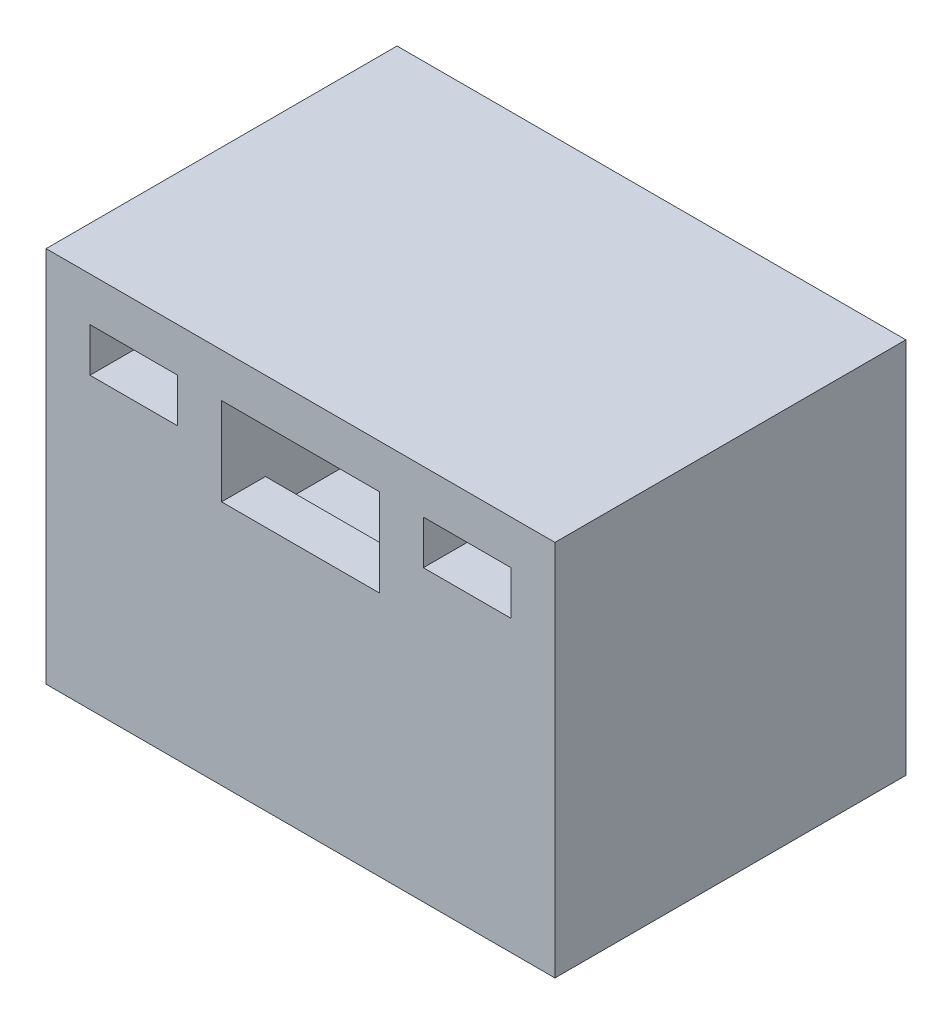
from build123d import *

# Parameters (mm, degrees)
SKETCH_1_W      = 5.8
SKETCH_1_H      = 4.3
SKETCH_1_W_2    = 1
SKETCH_1_H_2    = 0.5
SKETCH_1_W_3    = 1.8
SKETCH_1_H_3    = 1.349417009
EXTRUDE_1_DEPTH = 4
SKETCH_2_W      = 4.8
SKETCH_2_H      = 2.3
EXTRUDE_2_DEPTH = 0.5


with BuildPart() as part:
    # Sketch 1 → Extrude 1 (new body)
    with BuildSketch(Plane.XY):
        Rectangle(SKETCH_1_W, SKETCH_1_H)
        Polygon((1.4, -0.199417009), (-1.4, -0.199417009), (-1.4, 0.65), (-2.4, 0.65), (-2.4, -1.65), (2.4, -1.65), (2.4, 0.65), (1.4, 0.65), align=None, mode=Mode.SUBTRACT)
        with Locations((-1.9, 1.4)):
            Rectangle(SKETCH_1_W_2, SKETCH_1_H_2, mode=Mode.SUBTRACT)
        with Locations((0, 0.975291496)):
            Rectangle(SKETCH_1_W_3, SKETCH_1_H_3, mode=Mode.SUBTRACT)
        with Locations((1.9, 1.4)):
            Rectangle(SKETCH_1_W_2, SKETCH_1_H_2, mode=Mode.SUBTRACT)
    extrude(amount=EXTRUDE_1_DEPTH)

    # Sketch 2 → Extrude 2 (add)
    with BuildSketch(Plane.XY.offset(4)):
        with Locations((0, -0.5)):
            Rectangle(SKETCH_2_W, SKETCH_2_H)
    extrude(amount=-EXTRUDE_2_DEPTH)


solid = part.part
